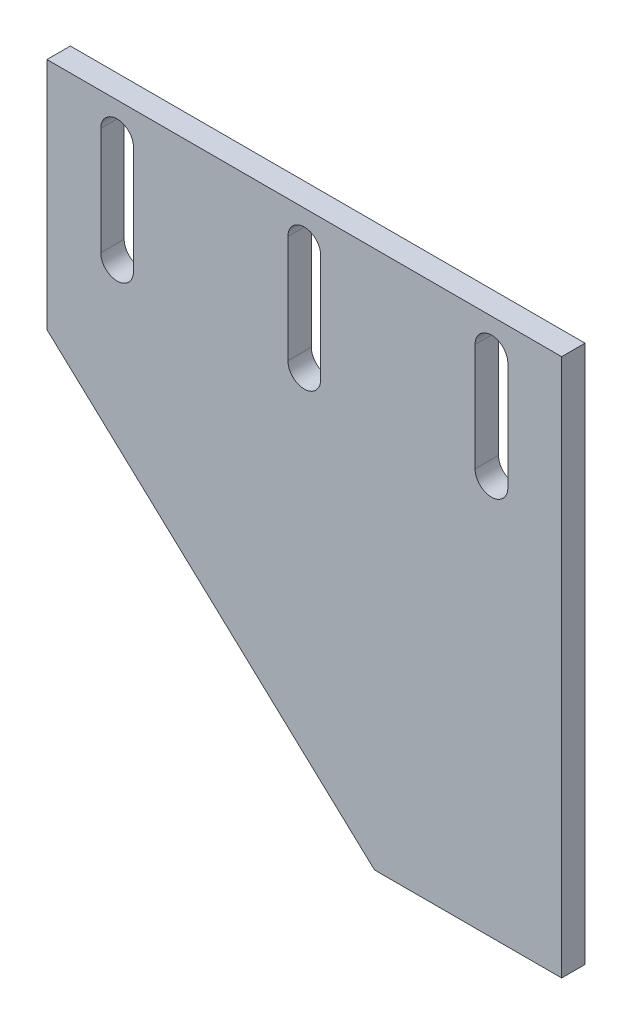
ISO-10303-21;
HEADER;
FILE_DESCRIPTION(('STEP AP214'),'2;1');
FILE_NAME('part.step','',(''),(''),'','','');
FILE_SCHEMA(('AUTOMOTIVE_DESIGN { 1 0 10303 214 1 1 1 1 }'));
ENDSEC;
DATA;
#1=APPLICATION_CONTEXT('core data for automotive mechanical design processes');
#2=APPLICATION_PROTOCOL_DEFINITION('international standard','automotive_design',2000,#1);
#3=PRODUCT_CONTEXT('',#1,'mechanical');
#4=PRODUCT('Part','Part','',(#3));
#5=PRODUCT_RELATED_PRODUCT_CATEGORY('part','',(#4));
#6=PRODUCT_DEFINITION_FORMATION('','',#4);
#7=PRODUCT_DEFINITION_CONTEXT('part definition',#1,'design');
#8=PRODUCT_DEFINITION('design','',#6,#7);
#9=PRODUCT_DEFINITION_SHAPE('','',#8);
#10=(LENGTH_UNIT() NAMED_UNIT(*) SI_UNIT(.MILLI.,.METRE.));
#11=(NAMED_UNIT(*) PLANE_ANGLE_UNIT() SI_UNIT($,.RADIAN.));
#12=(NAMED_UNIT(*) SI_UNIT($,.STERADIAN.) SOLID_ANGLE_UNIT());
#13=UNCERTAINTY_MEASURE_WITH_UNIT(LENGTH_MEASURE(1.E-05),#10,'distance_accuracy_value','');
#14=(GEOMETRIC_REPRESENTATION_CONTEXT(3) GLOBAL_UNCERTAINTY_ASSIGNED_CONTEXT((#13)) GLOBAL_UNIT_ASSIGNED_CONTEXT((#10,
#11,#12)) REPRESENTATION_CONTEXT('',''));
#15=CARTESIAN_POINT('',(0.,0.,0.));
#16=DIRECTION('',(0.,0.,1.));
#17=DIRECTION('',(1.,0.,0.));
#18=AXIS2_PLACEMENT_3D('',#15,#16,#17);
#19=CARTESIAN_POINT('',(-110.,115.,9.99999999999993));
#20=DIRECTION('',(0.,0.,1.));
#21=DIRECTION('',(1.,0.,0.));
#22=AXIS2_PLACEMENT_3D('',#19,#20,#21);
#23=PLANE('',#22);
#24=DIRECTION('',(0.,-1.,0.));
#25=VECTOR('',#24,1.);
#26=CARTESIAN_POINT('',(73.0000000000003,101.,9.9999999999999));
#27=LINE('',#26,#25);
#28=CARTESIAN_POINT('',(73.0000000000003,101.,9.9999999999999));
#29=VERTEX_POINT('',#28);
#30=CARTESIAN_POINT('',(73.0000000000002,55.,9.99999999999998));
#31=VERTEX_POINT('',#30);
#32=EDGE_CURVE('E198',#29,#31,#27,.T.);
#33=ORIENTED_EDGE('',*,*,#32,.F.);
#34=CARTESIAN_POINT('',(80.0000000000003,101.,9.99999999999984));
#35=DIRECTION('',(0.,0.,1.));
#36=DIRECTION('',(1.,0.,0.));
#37=AXIS2_PLACEMENT_3D('',#34,#35,#36);
#38=CIRCLE('',#37,7.00000000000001);
#39=CARTESIAN_POINT('',(87.0000000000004,101.,9.99999999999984));
#40=VERTEX_POINT('',#39);
#41=EDGE_CURVE('E196',#40,#29,#38,.T.);
#42=ORIENTED_EDGE('',*,*,#41,.F.);
#43=DIRECTION('',(0.,1.,0.));
#44=VECTOR('',#43,1.);
#45=CARTESIAN_POINT('',(87.0000000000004,101.,9.99999999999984));
#46=LINE('',#45,#44);
#47=CARTESIAN_POINT('',(87.0000000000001,55.,9.99999999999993));
#48=VERTEX_POINT('',#47);
#49=EDGE_CURVE('E203',#48,#40,#46,.T.);
#50=ORIENTED_EDGE('',*,*,#49,.F.);
#51=CARTESIAN_POINT('',(80.0000000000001,55.,9.9999999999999));
#52=DIRECTION('',(0.,0.,1.));
#53=DIRECTION('',(1.,0.,0.));
#54=AXIS2_PLACEMENT_3D('',#51,#52,#53);
#55=CIRCLE('',#54,6.99999999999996);
#56=EDGE_CURVE('E200',#31,#48,#55,.T.);
#57=ORIENTED_EDGE('',*,*,#56,.F.);
#58=EDGE_LOOP('',(#33,#42,#50,#57));
#59=FACE_BOUND('',#58,.T.);
#60=DIRECTION('',(0.,-1.,0.));
#61=VECTOR('',#60,1.);
#62=CARTESIAN_POINT('',(-110.,115.,9.99999999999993));
#63=LINE('',#62,#61);
#64=CARTESIAN_POINT('',(-110.,115.,9.99999999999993));
#65=VERTEX_POINT('',#64);
#66=CARTESIAN_POINT('',(-110.,14.9999999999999,9.99999999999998));
#67=VERTEX_POINT('',#66);
#68=EDGE_CURVE('E257',#65,#67,#63,.T.);
#69=ORIENTED_EDGE('',*,*,#68,.T.);
#70=DIRECTION('',(0.7327934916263,-0.680451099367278,0.));
#71=VECTOR('',#70,1.);
#72=CARTESIAN_POINT('',(-110.,14.9999999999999,9.99999999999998));
#73=LINE('',#72,#71);
#74=CARTESIAN_POINT('',(30.0000000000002,-115.,9.99999999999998));
#75=VERTEX_POINT('',#74);
#76=EDGE_CURVE('E260',#67,#75,#73,.T.);
#77=ORIENTED_EDGE('',*,*,#76,.T.);
#78=DIRECTION('',(1.,0.,0.));
#79=VECTOR('',#78,1.);
#80=CARTESIAN_POINT('',(30.0000000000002,-115.,9.99999999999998));
#81=LINE('',#80,#79);
#82=CARTESIAN_POINT('',(110.,-115.,10.));
#83=VERTEX_POINT('',#82);
#84=EDGE_CURVE('E262',#75,#83,#81,.T.);
#85=ORIENTED_EDGE('',*,*,#84,.T.);
#86=DIRECTION('',(0.,1.,0.));
#87=VECTOR('',#86,1.);
#88=CARTESIAN_POINT('',(110.,115.,9.99999999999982));
#89=LINE('',#88,#87);
#90=CARTESIAN_POINT('',(110.,115.,9.99999999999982));
#91=VERTEX_POINT('',#90);
#92=EDGE_CURVE('E264',#83,#91,#89,.T.);
#93=ORIENTED_EDGE('',*,*,#92,.T.);
#94=DIRECTION('',(-1.,0.,0.));
#95=VECTOR('',#94,1.);
#96=CARTESIAN_POINT('',(-110.,115.,9.99999999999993));
#97=LINE('',#96,#95);
#98=EDGE_CURVE('E266',#91,#65,#97,.T.);
#99=ORIENTED_EDGE('',*,*,#98,.T.);
#100=EDGE_LOOP('',(#69,#77,#85,#93,#99));
#101=FACE_BOUND('',#100,.T.);
#102=DIRECTION('',(0.,-1.,0.));
#103=VECTOR('',#102,1.);
#104=CARTESIAN_POINT('',(-6.99999999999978,101.,9.99999999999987));
#105=LINE('',#104,#103);
#106=CARTESIAN_POINT('',(-6.99999999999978,101.,9.99999999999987));
#107=VERTEX_POINT('',#106);
#108=CARTESIAN_POINT('',(-6.99999999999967,55.,10.));
#109=VERTEX_POINT('',#108);
#110=EDGE_CURVE('E229',#107,#109,#105,.T.);
#111=ORIENTED_EDGE('',*,*,#110,.F.);
#112=CARTESIAN_POINT('',(2.22044604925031E-13,101.,9.99999999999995));
#113=DIRECTION('',(0.,0.,1.));
#114=DIRECTION('',(1.,0.,0.));
#115=AXIS2_PLACEMENT_3D('',#112,#113,#114);
#116=CIRCLE('',#115,7.);
#117=CARTESIAN_POINT('',(7.00000000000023,101.,9.99999999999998));
#118=VERTEX_POINT('',#117);
#119=EDGE_CURVE('E227',#118,#107,#116,.T.);
#120=ORIENTED_EDGE('',*,*,#119,.F.);
#121=DIRECTION('',(0.,1.,0.));
#122=VECTOR('',#121,1.);
#123=CARTESIAN_POINT('',(7.00000000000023,101.,9.99999999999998));
#124=LINE('',#123,#122);
#125=CARTESIAN_POINT('',(7.00000000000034,55.,10.0000000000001));
#126=VERTEX_POINT('',#125);
#127=EDGE_CURVE('E234',#126,#118,#124,.T.);
#128=ORIENTED_EDGE('',*,*,#127,.F.);
#129=CARTESIAN_POINT('',(1.11022302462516E-13,55.,10.));
#130=DIRECTION('',(0.,0.,1.));
#131=DIRECTION('',(1.,0.,0.));
#132=AXIS2_PLACEMENT_3D('',#129,#130,#131);
#133=CIRCLE('',#132,6.99999999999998);
#134=EDGE_CURVE('E231',#109,#126,#133,.T.);
#135=ORIENTED_EDGE('',*,*,#134,.F.);
#136=EDGE_LOOP('',(#111,#120,#128,#135));
#137=FACE_BOUND('',#136,.T.);
#138=DIRECTION('',(0.,-1.,0.));
#139=VECTOR('',#138,1.);
#140=CARTESIAN_POINT('',(-86.9999999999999,101.,9.9999999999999));
#141=LINE('',#140,#139);
#142=CARTESIAN_POINT('',(-86.9999999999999,101.,9.9999999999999));
#143=VERTEX_POINT('',#142);
#144=CARTESIAN_POINT('',(-86.9999999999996,55.,9.99999999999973));
#145=VERTEX_POINT('',#144);
#146=EDGE_CURVE('E175',#143,#145,#141,.T.);
#147=ORIENTED_EDGE('',*,*,#146,.F.);
#148=CARTESIAN_POINT('',(-79.9999999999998,101.,9.99999999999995));
#149=DIRECTION('',(0.,0.,1.));
#150=DIRECTION('',(1.,0.,0.));
#151=AXIS2_PLACEMENT_3D('',#148,#149,#150);
#152=CIRCLE('',#151,7.00000000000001);
#153=CARTESIAN_POINT('',(-72.9999999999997,101.,9.99999999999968));
#154=VERTEX_POINT('',#153);
#155=EDGE_CURVE('E164',#154,#143,#152,.T.);
#156=ORIENTED_EDGE('',*,*,#155,.F.);
#157=DIRECTION('',(0.,1.,0.));
#158=VECTOR('',#157,1.);
#159=CARTESIAN_POINT('',(-72.9999999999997,101.,9.99999999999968));
#160=LINE('',#159,#158);
#161=CARTESIAN_POINT('',(-72.9999999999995,55.,9.9999999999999));
#162=VERTEX_POINT('',#161);
#163=EDGE_CURVE('E179',#162,#154,#160,.T.);
#164=ORIENTED_EDGE('',*,*,#163,.F.);
#165=CARTESIAN_POINT('',(-80.,54.9999999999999,9.99999999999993));
#166=DIRECTION('',(0.,0.,1.));
#167=DIRECTION('',(1.,0.,0.));
#168=AXIS2_PLACEMENT_3D('',#165,#166,#167);
#169=CIRCLE('',#168,6.99999999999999);
#170=EDGE_CURVE('E177',#145,#162,#169,.T.);
#171=ORIENTED_EDGE('',*,*,#170,.F.);
#172=EDGE_LOOP('',(#147,#156,#164,#171));
#173=FACE_BOUND('',#172,.T.);
#174=ADVANCED_FACE('F30',(#59,#101,#137,#173),#23,.T.);
#175=CARTESIAN_POINT('',(-110.,115.,0.));
#176=DIRECTION('',(0.,0.,1.));
#177=DIRECTION('',(1.,0.,0.));
#178=AXIS2_PLACEMENT_3D('',#175,#176,#177);
#179=PLANE('',#178);
#180=CARTESIAN_POINT('',(80.0000000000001,101.,-1.11022302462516E-13));
#181=DIRECTION('',(0.,0.,1.));
#182=DIRECTION('',(1.,0.,0.));
#183=AXIS2_PLACEMENT_3D('',#180,#181,#182);
#184=CIRCLE('',#183,7.00000000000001);
#185=CARTESIAN_POINT('',(87.0000000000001,101.,-2.22044604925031E-13));
#186=VERTEX_POINT('',#185);
#187=CARTESIAN_POINT('',(73.,101.,-2.22044604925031E-13));
#188=VERTEX_POINT('',#187);
#189=EDGE_CURVE('E165',#186,#188,#184,.T.);
#190=ORIENTED_EDGE('',*,*,#189,.T.);
#191=DIRECTION('',(0.,-1.,0.));
#192=VECTOR('',#191,1.);
#193=CARTESIAN_POINT('',(73.,101.,-2.22044604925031E-13));
#194=LINE('',#193,#192);
#195=CARTESIAN_POINT('',(73.,54.9999999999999,0.));
#196=VERTEX_POINT('',#195);
#197=EDGE_CURVE('E187',#188,#196,#194,.T.);
#198=ORIENTED_EDGE('',*,*,#197,.T.);
#199=CARTESIAN_POINT('',(80.0000000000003,54.9999999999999,-2.4980018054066E-13));
#200=DIRECTION('',(0.,0.,1.));
#201=DIRECTION('',(1.,0.,0.));
#202=AXIS2_PLACEMENT_3D('',#199,#200,#201);
#203=CIRCLE('',#202,6.99999999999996);
#204=CARTESIAN_POINT('',(87.,55.,-1.94289029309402E-13));
#205=VERTEX_POINT('',#204);
#206=EDGE_CURVE('E190',#196,#205,#203,.T.);
#207=ORIENTED_EDGE('',*,*,#206,.T.);
#208=DIRECTION('',(0.,1.,0.));
#209=VECTOR('',#208,1.);
#210=CARTESIAN_POINT('',(87.0000000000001,101.,-2.22044604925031E-13));
#211=LINE('',#210,#209);
#212=EDGE_CURVE('E193',#205,#186,#211,.T.);
#213=ORIENTED_EDGE('',*,*,#212,.T.);
#214=EDGE_LOOP('',(#190,#198,#207,#213));
#215=FACE_BOUND('',#214,.T.);
#216=DIRECTION('',(0.,-1.,0.));
#217=VECTOR('',#216,1.);
#218=CARTESIAN_POINT('',(-110.,115.,0.));
#219=LINE('',#218,#217);
#220=CARTESIAN_POINT('',(-110.,115.,0.));
#221=VERTEX_POINT('',#220);
#222=CARTESIAN_POINT('',(-110.,14.9999999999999,0.));
#223=VERTEX_POINT('',#222);
#224=EDGE_CURVE('E246',#221,#223,#219,.T.);
#225=ORIENTED_EDGE('',*,*,#224,.F.);
#226=DIRECTION('',(-1.,0.,0.));
#227=VECTOR('',#226,1.);
#228=CARTESIAN_POINT('',(-110.,115.,0.));
#229=LINE('',#228,#227);
#230=CARTESIAN_POINT('',(110.,115.,-1.38777878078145E-13));
#231=VERTEX_POINT('',#230);
#232=EDGE_CURVE('E255',#231,#221,#229,.T.);
#233=ORIENTED_EDGE('',*,*,#232,.F.);
#234=DIRECTION('',(0.,1.,0.));
#235=VECTOR('',#234,1.);
#236=CARTESIAN_POINT('',(110.,115.,-1.38777878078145E-13));
#237=LINE('',#236,#235);
#238=CARTESIAN_POINT('',(110.,-115.,0.));
#239=VERTEX_POINT('',#238);
#240=EDGE_CURVE('E253',#239,#231,#237,.T.);
#241=ORIENTED_EDGE('',*,*,#240,.F.);
#242=DIRECTION('',(1.,0.,0.));
#243=VECTOR('',#242,1.);
#244=CARTESIAN_POINT('',(30.0000000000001,-115.,0.));
#245=LINE('',#244,#243);
#246=CARTESIAN_POINT('',(30.0000000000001,-115.,0.));
#247=VERTEX_POINT('',#246);
#248=EDGE_CURVE('E251',#247,#239,#245,.T.);
#249=ORIENTED_EDGE('',*,*,#248,.F.);
#250=DIRECTION('',(0.7327934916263,-0.680451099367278,0.));
#251=VECTOR('',#250,1.);
#252=CARTESIAN_POINT('',(-110.,14.9999999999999,0.));
#253=LINE('',#252,#251);
#254=EDGE_CURVE('E249',#223,#247,#253,.T.);
#255=ORIENTED_EDGE('',*,*,#254,.F.);
#256=EDGE_LOOP('',(#225,#233,#241,#249,#255));
#257=FACE_BOUND('',#256,.T.);
#258=CARTESIAN_POINT('',(0.,101.,0.));
#259=DIRECTION('',(0.,0.,1.));
#260=DIRECTION('',(1.,0.,0.));
#261=AXIS2_PLACEMENT_3D('',#258,#259,#260);
#262=CIRCLE('',#261,7.);
#263=CARTESIAN_POINT('',(7.00000000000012,101.,0.));
#264=VERTEX_POINT('',#263);
#265=CARTESIAN_POINT('',(-7.00000000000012,101.,0.));
#266=VERTEX_POINT('',#265);
#267=EDGE_CURVE('E215',#264,#266,#262,.T.);
#268=ORIENTED_EDGE('',*,*,#267,.T.);
#269=DIRECTION('',(0.,-1.,0.));
#270=VECTOR('',#269,1.);
#271=CARTESIAN_POINT('',(-7.00000000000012,101.,0.));
#272=LINE('',#271,#270);
#273=CARTESIAN_POINT('',(-7.00000000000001,55.0000000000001,0.));
#274=VERTEX_POINT('',#273);
#275=EDGE_CURVE('E218',#266,#274,#272,.T.);
#276=ORIENTED_EDGE('',*,*,#275,.T.);
#277=CARTESIAN_POINT('',(-1.11022302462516E-13,55.,0.));
#278=DIRECTION('',(0.,0.,1.));
#279=DIRECTION('',(1.,0.,0.));
#280=AXIS2_PLACEMENT_3D('',#277,#278,#279);
#281=CIRCLE('',#280,6.99999999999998);
#282=CARTESIAN_POINT('',(6.9999999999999,55.,0.));
#283=VERTEX_POINT('',#282);
#284=EDGE_CURVE('E221',#274,#283,#281,.T.);
#285=ORIENTED_EDGE('',*,*,#284,.T.);
#286=DIRECTION('',(0.,1.,0.));
#287=VECTOR('',#286,1.);
#288=CARTESIAN_POINT('',(7.00000000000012,101.,0.));
#289=LINE('',#288,#287);
#290=EDGE_CURVE('E224',#283,#264,#289,.T.);
#291=ORIENTED_EDGE('',*,*,#290,.T.);
#292=EDGE_LOOP('',(#268,#276,#285,#291));
#293=FACE_BOUND('',#292,.T.);
#294=CARTESIAN_POINT('',(-80.0000000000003,101.,-1.94289029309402E-13));
#295=DIRECTION('',(0.,0.,1.));
#296=DIRECTION('',(1.,0.,0.));
#297=AXIS2_PLACEMENT_3D('',#294,#295,#296);
#298=CIRCLE('',#297,7.00000000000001);
#299=CARTESIAN_POINT('',(-73.,101.,0.));
#300=VERTEX_POINT('',#299);
#301=CARTESIAN_POINT('',(-86.9999999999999,101.,-1.11022302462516E-13));
#302=VERTEX_POINT('',#301);
#303=EDGE_CURVE('E53',#300,#302,#298,.T.);
#304=ORIENTED_EDGE('',*,*,#303,.T.);
#305=DIRECTION('',(0.,-1.,0.));
#306=VECTOR('',#305,1.);
#307=CARTESIAN_POINT('',(-86.9999999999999,101.,-1.11022302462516E-13));
#308=LINE('',#307,#306);
#309=CARTESIAN_POINT('',(-86.9999999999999,54.9999999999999,-2.22044604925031E-13));
#310=VERTEX_POINT('',#309);
#311=EDGE_CURVE('E151',#302,#310,#308,.T.);
#312=ORIENTED_EDGE('',*,*,#311,.T.);
#313=CARTESIAN_POINT('',(-80.0000000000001,55.,-1.11022302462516E-13));
#314=DIRECTION('',(0.,0.,1.));
#315=DIRECTION('',(1.,0.,0.));
#316=AXIS2_PLACEMENT_3D('',#313,#314,#315);
#317=CIRCLE('',#316,6.99999999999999);
#318=CARTESIAN_POINT('',(-73.0000000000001,54.9999999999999,-1.38777878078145E-13));
#319=VERTEX_POINT('',#318);
#320=EDGE_CURVE('E160',#310,#319,#317,.T.);
#321=ORIENTED_EDGE('',*,*,#320,.T.);
#322=DIRECTION('',(0.,1.,0.));
#323=VECTOR('',#322,1.);
#324=CARTESIAN_POINT('',(-73.,101.,0.));
#325=LINE('',#324,#323);
#326=EDGE_CURVE('E169',#319,#300,#325,.T.);
#327=ORIENTED_EDGE('',*,*,#326,.T.);
#328=EDGE_LOOP('',(#304,#312,#321,#327));
#329=FACE_BOUND('',#328,.T.);
#330=ADVANCED_FACE('F168',(#215,#257,#293,#329),#179,.F.);
#331=CARTESIAN_POINT('',(-110.,115.,9.99999999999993));
#332=DIRECTION('',(1.,0.,0.));
#333=DIRECTION('',(0.,1.,0.));
#334=AXIS2_PLACEMENT_3D('',#331,#332,#333);
#335=PLANE('',#334);
#336=ORIENTED_EDGE('',*,*,#224,.T.);
#337=DIRECTION('',(0.,0.,-1.));
#338=VECTOR('',#337,1.);
#339=CARTESIAN_POINT('',(-110.,14.9999999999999,9.99999999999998));
#340=LINE('',#339,#338);
#341=EDGE_CURVE('E11',#67,#223,#340,.T.);
#342=ORIENTED_EDGE('',*,*,#341,.F.);
#343=ORIENTED_EDGE('',*,*,#68,.F.);
#344=DIRECTION('',(0.,0.,-1.));
#345=VECTOR('',#344,1.);
#346=CARTESIAN_POINT('',(-110.,115.,9.99999999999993));
#347=LINE('',#346,#345);
#348=EDGE_CURVE('E268',#65,#221,#347,.T.);
#349=ORIENTED_EDGE('',*,*,#348,.T.);
#350=EDGE_LOOP('',(#336,#342,#343,#349));
#351=FACE_BOUND('',#350,.T.);
#352=ADVANCED_FACE('F32',(#351),#335,.F.);
#353=CARTESIAN_POINT('',(-110.,14.9999999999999,9.99999999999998));
#354=DIRECTION('',(0.680451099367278,0.7327934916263,0.));
#355=DIRECTION('',(-0.7327934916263,0.680451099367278,0.));
#356=AXIS2_PLACEMENT_3D('',#353,#354,#355);
#357=PLANE('',#356);
#358=ORIENTED_EDGE('',*,*,#254,.T.);
#359=DIRECTION('',(0.,0.,-1.));
#360=VECTOR('',#359,1.);
#361=CARTESIAN_POINT('',(30.0000000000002,-115.,9.99999999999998));
#362=LINE('',#361,#360);
#363=EDGE_CURVE('E38',#75,#247,#362,.T.);
#364=ORIENTED_EDGE('',*,*,#363,.F.);
#365=ORIENTED_EDGE('',*,*,#76,.F.);
#366=ORIENTED_EDGE('',*,*,#341,.T.);
#367=EDGE_LOOP('',(#358,#364,#365,#366));
#368=FACE_BOUND('',#367,.T.);
#369=ADVANCED_FACE('F301',(#368),#357,.F.);
#370=CARTESIAN_POINT('',(30.0000000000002,-115.,9.99999999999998));
#371=DIRECTION('',(0.,1.,0.));
#372=DIRECTION('',(0.,0.,1.));
#373=AXIS2_PLACEMENT_3D('',#370,#371,#372);
#374=PLANE('',#373);
#375=ORIENTED_EDGE('',*,*,#248,.T.);
#376=DIRECTION('',(0.,0.,-1.));
#377=VECTOR('',#376,1.);
#378=CARTESIAN_POINT('',(110.,-115.,10.));
#379=LINE('',#378,#377);
#380=EDGE_CURVE('E274',#83,#239,#379,.T.);
#381=ORIENTED_EDGE('',*,*,#380,.F.);
#382=ORIENTED_EDGE('',*,*,#84,.F.);
#383=ORIENTED_EDGE('',*,*,#363,.T.);
#384=EDGE_LOOP('',(#375,#381,#382,#383));
#385=FACE_BOUND('',#384,.T.);
#386=ADVANCED_FACE('F281',(#385),#374,.F.);
#387=CARTESIAN_POINT('',(110.,115.,9.99999999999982));
#388=DIRECTION('',(-1.,0.,0.));
#389=DIRECTION('',(0.,-1.,0.));
#390=AXIS2_PLACEMENT_3D('',#387,#388,#389);
#391=PLANE('',#390);
#392=ORIENTED_EDGE('',*,*,#240,.T.);
#393=DIRECTION('',(0.,0.,-1.));
#394=VECTOR('',#393,1.);
#395=CARTESIAN_POINT('',(110.,115.,9.99999999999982));
#396=LINE('',#395,#394);
#397=EDGE_CURVE('E271',#91,#231,#396,.T.);
#398=ORIENTED_EDGE('',*,*,#397,.F.);
#399=ORIENTED_EDGE('',*,*,#92,.F.);
#400=ORIENTED_EDGE('',*,*,#380,.T.);
#401=EDGE_LOOP('',(#392,#398,#399,#400));
#402=FACE_BOUND('',#401,.T.);
#403=ADVANCED_FACE('F291',(#402),#391,.F.);
#404=CARTESIAN_POINT('',(-110.,115.,9.99999999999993));
#405=DIRECTION('',(0.,-1.,0.));
#406=DIRECTION('',(1.,0.,0.));
#407=AXIS2_PLACEMENT_3D('',#404,#405,#406);
#408=PLANE('',#407);
#409=ORIENTED_EDGE('',*,*,#232,.T.);
#410=ORIENTED_EDGE('',*,*,#348,.F.);
#411=ORIENTED_EDGE('',*,*,#98,.F.);
#412=ORIENTED_EDGE('',*,*,#397,.T.);
#413=EDGE_LOOP('',(#409,#410,#411,#412));
#414=FACE_BOUND('',#413,.T.);
#415=ADVANCED_FACE('F295',(#414),#408,.F.);
#416=CARTESIAN_POINT('',(2.22044604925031E-13,101.,9.99999999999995));
#417=DIRECTION('',(0.,0.,-1.));
#418=DIRECTION('',(-1.,0.,0.));
#419=AXIS2_PLACEMENT_3D('',#416,#417,#418);
#420=CYLINDRICAL_SURFACE('',#419,7.);
#421=ORIENTED_EDGE('',*,*,#267,.F.);
#422=DIRECTION('',(0.,0.,-1.));
#423=VECTOR('',#422,1.);
#424=CARTESIAN_POINT('',(7.00000000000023,101.,9.99999999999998));
#425=LINE('',#424,#423);
#426=EDGE_CURVE('E236',#118,#264,#425,.T.);
#427=ORIENTED_EDGE('',*,*,#426,.F.);
#428=ORIENTED_EDGE('',*,*,#119,.T.);
#429=DIRECTION('',(0.,0.,-1.));
#430=VECTOR('',#429,1.);
#431=CARTESIAN_POINT('',(-6.99999999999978,101.,9.99999999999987));
#432=LINE('',#431,#430);
#433=EDGE_CURVE('E243',#107,#266,#432,.T.);
#434=ORIENTED_EDGE('',*,*,#433,.T.);
#435=EDGE_LOOP('',(#421,#427,#428,#434));
#436=FACE_BOUND('',#435,.T.);
#437=ADVANCED_FACE('F320',(#436),#420,.F.);
#438=CARTESIAN_POINT('',(-6.99999999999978,101.,9.99999999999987));
#439=DIRECTION('',(1.,0.,0.));
#440=DIRECTION('',(0.,1.,0.));
#441=AXIS2_PLACEMENT_3D('',#438,#439,#440);
#442=PLANE('',#441);
#443=ORIENTED_EDGE('',*,*,#275,.F.);
#444=ORIENTED_EDGE('',*,*,#433,.F.);
#445=ORIENTED_EDGE('',*,*,#110,.T.);
#446=DIRECTION('',(0.,0.,-1.));
#447=VECTOR('',#446,1.);
#448=CARTESIAN_POINT('',(-6.99999999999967,55.,10.));
#449=LINE('',#448,#447);
#450=EDGE_CURVE('E241',#109,#274,#449,.T.);
#451=ORIENTED_EDGE('',*,*,#450,.T.);
#452=EDGE_LOOP('',(#443,#444,#445,#451));
#453=FACE_BOUND('',#452,.T.);
#454=ADVANCED_FACE('F342',(#453),#442,.T.);
#455=CARTESIAN_POINT('',(1.11022302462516E-13,55.,10.));
#456=DIRECTION('',(0.,0.,-1.));
#457=DIRECTION('',(-1.,0.,0.));
#458=AXIS2_PLACEMENT_3D('',#455,#456,#457);
#459=CYLINDRICAL_SURFACE('',#458,6.99999999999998);
#460=ORIENTED_EDGE('',*,*,#284,.F.);
#461=ORIENTED_EDGE('',*,*,#450,.F.);
#462=ORIENTED_EDGE('',*,*,#134,.T.);
#463=DIRECTION('',(0.,0.,-1.));
#464=VECTOR('',#463,1.);
#465=CARTESIAN_POINT('',(7.00000000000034,55.,10.0000000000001));
#466=LINE('',#465,#464);
#467=EDGE_CURVE('E239',#126,#283,#466,.T.);
#468=ORIENTED_EDGE('',*,*,#467,.T.);
#469=EDGE_LOOP('',(#460,#461,#462,#468));
#470=FACE_BOUND('',#469,.T.);
#471=ADVANCED_FACE('F349',(#470),#459,.F.);
#472=CARTESIAN_POINT('',(7.00000000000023,101.,9.99999999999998));
#473=DIRECTION('',(-1.,0.,0.));
#474=DIRECTION('',(0.,-1.,0.));
#475=AXIS2_PLACEMENT_3D('',#472,#473,#474);
#476=PLANE('',#475);
#477=ORIENTED_EDGE('',*,*,#290,.F.);
#478=ORIENTED_EDGE('',*,*,#467,.F.);
#479=ORIENTED_EDGE('',*,*,#127,.T.);
#480=ORIENTED_EDGE('',*,*,#426,.T.);
#481=EDGE_LOOP('',(#477,#478,#479,#480));
#482=FACE_BOUND('',#481,.T.);
#483=ADVANCED_FACE('F357',(#482),#476,.T.);
#484=CARTESIAN_POINT('',(80.0000000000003,101.,9.99999999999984));
#485=DIRECTION('',(0.,0.,-1.));
#486=DIRECTION('',(-1.,0.,0.));
#487=AXIS2_PLACEMENT_3D('',#484,#485,#486);
#488=CYLINDRICAL_SURFACE('',#487,7.00000000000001);
#489=ORIENTED_EDGE('',*,*,#189,.F.);
#490=DIRECTION('',(0.,0.,-1.));
#491=VECTOR('',#490,1.);
#492=CARTESIAN_POINT('',(87.0000000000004,101.,9.99999999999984));
#493=LINE('',#492,#491);
#494=EDGE_CURVE('E205',#40,#186,#493,.T.);
#495=ORIENTED_EDGE('',*,*,#494,.F.);
#496=ORIENTED_EDGE('',*,*,#41,.T.);
#497=DIRECTION('',(0.,0.,-1.));
#498=VECTOR('',#497,1.);
#499=CARTESIAN_POINT('',(73.0000000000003,101.,9.9999999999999));
#500=LINE('',#499,#498);
#501=EDGE_CURVE('E212',#29,#188,#500,.T.);
#502=ORIENTED_EDGE('',*,*,#501,.T.);
#503=EDGE_LOOP('',(#489,#495,#496,#502));
#504=FACE_BOUND('',#503,.T.);
#505=ADVANCED_FACE('F365',(#504),#488,.F.);
#506=CARTESIAN_POINT('',(73.0000000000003,101.,9.9999999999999));
#507=DIRECTION('',(1.,0.,0.));
#508=DIRECTION('',(0.,1.,0.));
#509=AXIS2_PLACEMENT_3D('',#506,#507,#508);
#510=PLANE('',#509);
#511=ORIENTED_EDGE('',*,*,#197,.F.);
#512=ORIENTED_EDGE('',*,*,#501,.F.);
#513=ORIENTED_EDGE('',*,*,#32,.T.);
#514=DIRECTION('',(0.,0.,-1.));
#515=VECTOR('',#514,1.);
#516=CARTESIAN_POINT('',(73.0000000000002,55.,9.99999999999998));
#517=LINE('',#516,#515);
#518=EDGE_CURVE('E210',#31,#196,#517,.T.);
#519=ORIENTED_EDGE('',*,*,#518,.T.);
#520=EDGE_LOOP('',(#511,#512,#513,#519));
#521=FACE_BOUND('',#520,.T.);
#522=ADVANCED_FACE('F373',(#521),#510,.T.);
#523=CARTESIAN_POINT('',(80.0000000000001,55.,9.9999999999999));
#524=DIRECTION('',(0.,0.,-1.));
#525=DIRECTION('',(-1.,0.,0.));
#526=AXIS2_PLACEMENT_3D('',#523,#524,#525);
#527=CYLINDRICAL_SURFACE('',#526,6.99999999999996);
#528=ORIENTED_EDGE('',*,*,#206,.F.);
#529=ORIENTED_EDGE('',*,*,#518,.F.);
#530=ORIENTED_EDGE('',*,*,#56,.T.);
#531=DIRECTION('',(0.,0.,-1.));
#532=VECTOR('',#531,1.);
#533=CARTESIAN_POINT('',(87.0000000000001,55.,9.99999999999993));
#534=LINE('',#533,#532);
#535=EDGE_CURVE('E208',#48,#205,#534,.T.);
#536=ORIENTED_EDGE('',*,*,#535,.T.);
#537=EDGE_LOOP('',(#528,#529,#530,#536));
#538=FACE_BOUND('',#537,.T.);
#539=ADVANCED_FACE('F381',(#538),#527,.F.);
#540=CARTESIAN_POINT('',(87.0000000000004,101.,9.99999999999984));
#541=DIRECTION('',(-1.,0.,0.));
#542=DIRECTION('',(0.,-1.,0.));
#543=AXIS2_PLACEMENT_3D('',#540,#541,#542);
#544=PLANE('',#543);
#545=ORIENTED_EDGE('',*,*,#212,.F.);
#546=ORIENTED_EDGE('',*,*,#535,.F.);
#547=ORIENTED_EDGE('',*,*,#49,.T.);
#548=ORIENTED_EDGE('',*,*,#494,.T.);
#549=EDGE_LOOP('',(#545,#546,#547,#548));
#550=FACE_BOUND('',#549,.T.);
#551=ADVANCED_FACE('F389',(#550),#544,.T.);
#552=CARTESIAN_POINT('',(-79.9999999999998,101.,9.99999999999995));
#553=DIRECTION('',(0.,0.,-1.));
#554=DIRECTION('',(-1.,0.,0.));
#555=AXIS2_PLACEMENT_3D('',#552,#553,#554);
#556=CYLINDRICAL_SURFACE('',#555,7.00000000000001);
#557=ORIENTED_EDGE('',*,*,#303,.F.);
#558=DIRECTION('',(0.,0.,-1.));
#559=VECTOR('',#558,1.);
#560=CARTESIAN_POINT('',(-72.9999999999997,101.,9.99999999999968));
#561=LINE('',#560,#559);
#562=EDGE_CURVE('E181',#154,#300,#561,.T.);
#563=ORIENTED_EDGE('',*,*,#562,.F.);
#564=ORIENTED_EDGE('',*,*,#155,.T.);
#565=DIRECTION('',(0.,0.,-1.));
#566=VECTOR('',#565,1.);
#567=CARTESIAN_POINT('',(-86.9999999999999,101.,9.9999999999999));
#568=LINE('',#567,#566);
#569=EDGE_CURVE('E153',#143,#302,#568,.T.);
#570=ORIENTED_EDGE('',*,*,#569,.T.);
#571=EDGE_LOOP('',(#557,#563,#564,#570));
#572=FACE_BOUND('',#571,.T.);
#573=ADVANCED_FACE('F162',(#572),#556,.F.);
#574=CARTESIAN_POINT('',(-86.9999999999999,101.,9.9999999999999));
#575=DIRECTION('',(1.,0.,0.));
#576=DIRECTION('',(0.,1.,0.));
#577=AXIS2_PLACEMENT_3D('',#574,#575,#576);
#578=PLANE('',#577);
#579=ORIENTED_EDGE('',*,*,#311,.F.);
#580=ORIENTED_EDGE('',*,*,#569,.F.);
#581=ORIENTED_EDGE('',*,*,#146,.T.);
#582=DIRECTION('',(0.,0.,-1.));
#583=VECTOR('',#582,1.);
#584=CARTESIAN_POINT('',(-86.9999999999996,55.,9.99999999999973));
#585=LINE('',#584,#583);
#586=EDGE_CURVE('E156',#145,#310,#585,.T.);
#587=ORIENTED_EDGE('',*,*,#586,.T.);
#588=EDGE_LOOP('',(#579,#580,#581,#587));
#589=FACE_BOUND('',#588,.T.);
#590=ADVANCED_FACE('F152',(#589),#578,.T.);
#591=CARTESIAN_POINT('',(-80.,54.9999999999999,9.99999999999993));
#592=DIRECTION('',(0.,0.,-1.));
#593=DIRECTION('',(-1.,0.,0.));
#594=AXIS2_PLACEMENT_3D('',#591,#592,#593);
#595=CYLINDRICAL_SURFACE('',#594,6.99999999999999);
#596=ORIENTED_EDGE('',*,*,#320,.F.);
#597=ORIENTED_EDGE('',*,*,#586,.F.);
#598=ORIENTED_EDGE('',*,*,#170,.T.);
#599=DIRECTION('',(0.,0.,-1.));
#600=VECTOR('',#599,1.);
#601=CARTESIAN_POINT('',(-72.9999999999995,55.,9.9999999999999));
#602=LINE('',#601,#600);
#603=EDGE_CURVE('E45',#162,#319,#602,.T.);
#604=ORIENTED_EDGE('',*,*,#603,.T.);
#605=EDGE_LOOP('',(#596,#597,#598,#604));
#606=FACE_BOUND('',#605,.T.);
#607=ADVANCED_FACE('F410',(#606),#595,.F.);
#608=CARTESIAN_POINT('',(-72.9999999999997,101.,9.99999999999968));
#609=DIRECTION('',(-1.,0.,0.));
#610=DIRECTION('',(0.,-1.,0.));
#611=AXIS2_PLACEMENT_3D('',#608,#609,#610);
#612=PLANE('',#611);
#613=ORIENTED_EDGE('',*,*,#326,.F.);
#614=ORIENTED_EDGE('',*,*,#603,.F.);
#615=ORIENTED_EDGE('',*,*,#163,.T.);
#616=ORIENTED_EDGE('',*,*,#562,.T.);
#617=EDGE_LOOP('',(#613,#614,#615,#616));
#618=FACE_BOUND('',#617,.T.);
#619=ADVANCED_FACE('F417',(#618),#612,.T.);
#620=CLOSED_SHELL('',(#174,#330,#352,#369,#386,#403,#415,#437,#454,#471,#483,#505,#522,#539,
#551,#573,#590,#607,#619));
#621=MANIFOLD_SOLID_BREP('B2',#620);
#622=ADVANCED_BREP_SHAPE_REPRESENTATION('',(#18,#621),#14);
#623=SHAPE_DEFINITION_REPRESENTATION(#9,#622);
ENDSEC;
END-ISO-10303-21;
